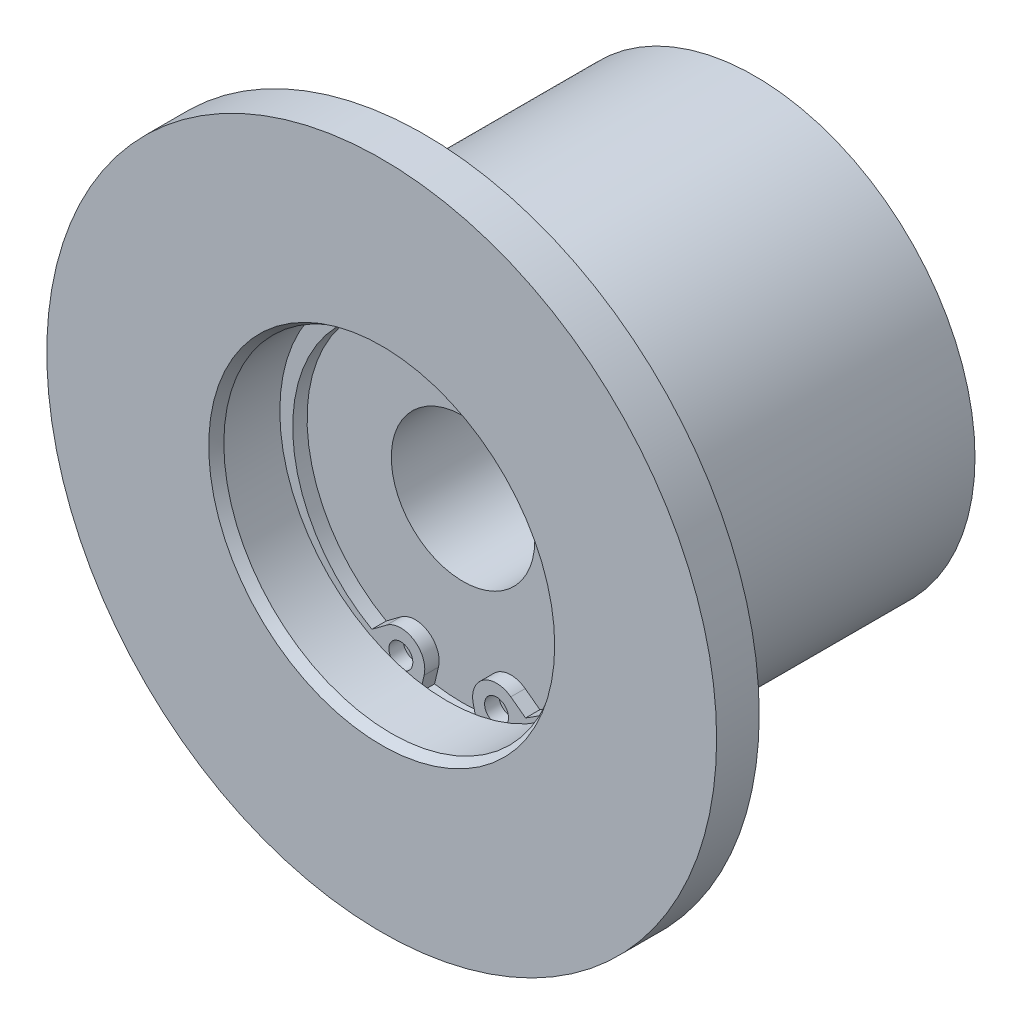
ISO-10303-21;
HEADER;
FILE_DESCRIPTION(('STEP AP214'),'2;1');
FILE_NAME('part.step','',(''),(''),'','','');
FILE_SCHEMA(('AUTOMOTIVE_DESIGN { 1 0 10303 214 1 1 1 1 }'));
ENDSEC;
DATA;
#1=APPLICATION_CONTEXT('core data for automotive mechanical design processes');
#2=APPLICATION_PROTOCOL_DEFINITION('international standard','automotive_design',2000,#1);
#3=PRODUCT_CONTEXT('',#1,'mechanical');
#4=PRODUCT('Part','Part','',(#3));
#5=PRODUCT_RELATED_PRODUCT_CATEGORY('part','',(#4));
#6=PRODUCT_DEFINITION_FORMATION('','',#4);
#7=PRODUCT_DEFINITION_CONTEXT('part definition',#1,'design');
#8=PRODUCT_DEFINITION('design','',#6,#7);
#9=PRODUCT_DEFINITION_SHAPE('','',#8);
#10=(LENGTH_UNIT() NAMED_UNIT(*) SI_UNIT(.MILLI.,.METRE.));
#11=(NAMED_UNIT(*) PLANE_ANGLE_UNIT() SI_UNIT($,.RADIAN.));
#12=(NAMED_UNIT(*) SI_UNIT($,.STERADIAN.) SOLID_ANGLE_UNIT());
#13=UNCERTAINTY_MEASURE_WITH_UNIT(LENGTH_MEASURE(1.E-05),#10,'distance_accuracy_value','');
#14=(GEOMETRIC_REPRESENTATION_CONTEXT(3) GLOBAL_UNCERTAINTY_ASSIGNED_CONTEXT((#13)) GLOBAL_UNIT_ASSIGNED_CONTEXT((#10,
#11,#12)) REPRESENTATION_CONTEXT('',''));
#15=CARTESIAN_POINT('',(0.,0.,0.));
#16=DIRECTION('',(0.,0.,1.));
#17=DIRECTION('',(1.,0.,0.));
#18=AXIS2_PLACEMENT_3D('',#15,#16,#17);
#19=CARTESIAN_POINT('',(0.,-0.9,12.6));
#20=DIRECTION('',(0.,0.,1.));
#21=DIRECTION('',(-1.,0.,0.));
#22=AXIS2_PLACEMENT_3D('',#19,#20,#21);
#23=CYLINDRICAL_SURFACE('',#22,16.3);
#24=CARTESIAN_POINT('',(0.,-0.9,12.5));
#25=DIRECTION('',(0.,0.,1.));
#26=DIRECTION('',(1.,0.,0.));
#27=AXIS2_PLACEMENT_3D('',#24,#25,#26);
#28=CIRCLE('',#27,16.3);
#29=CARTESIAN_POINT('',(-8.02922574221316,-15.0852576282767,12.5));
#30=VERTEX_POINT('',#29);
#31=CARTESIAN_POINT('',(8.02922574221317,-15.0852576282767,12.5));
#32=VERTEX_POINT('',#31);
#33=EDGE_CURVE('E275',#30,#32,#28,.F.);
#34=ORIENTED_EDGE('',*,*,#33,.F.);
#35=DIRECTION('',(0.,0.,-1.));
#36=VECTOR('',#35,1.);
#37=CARTESIAN_POINT('',(-8.02922574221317,-15.0852576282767,12.6));
#38=LINE('',#37,#36);
#39=CARTESIAN_POINT('',(-8.02922574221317,-15.0852576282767,11.));
#40=VERTEX_POINT('',#39);
#41=EDGE_CURVE('E240',#30,#40,#38,.T.);
#42=ORIENTED_EDGE('',*,*,#41,.T.);
#43=CARTESIAN_POINT('',(0.,-0.9,11.));
#44=DIRECTION('',(0.,0.,-1.));
#45=DIRECTION('',(0.,-1.,0.));
#46=AXIS2_PLACEMENT_3D('',#43,#44,#45);
#47=CIRCLE('',#46,16.3);
#48=CARTESIAN_POINT('',(8.02922574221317,-15.0852576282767,11.));
#49=VERTEX_POINT('',#48);
#50=EDGE_CURVE('E226',#40,#49,#47,.T.);
#51=ORIENTED_EDGE('',*,*,#50,.T.);
#52=DIRECTION('',(0.,0.,-1.));
#53=VECTOR('',#52,1.);
#54=CARTESIAN_POINT('',(8.02922574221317,-15.0852576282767,12.6));
#55=LINE('',#54,#53);
#56=EDGE_CURVE('E241',#32,#49,#55,.T.);
#57=ORIENTED_EDGE('',*,*,#56,.F.);
#58=EDGE_LOOP('',(#34,#42,#51,#57));
#59=FACE_BOUND('',#58,.T.);
#60=ADVANCED_FACE('F14',(#59),#23,.F.);
#61=CARTESIAN_POINT('',(6.49138441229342,-13.9421779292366,12.6));
#62=DIRECTION('',(-0.596553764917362,-0.802573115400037,0.));
#63=DIRECTION('',(-0.802573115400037,0.596553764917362,0.));
#64=AXIS2_PLACEMENT_3D('',#61,#62,#63);
#65=PLANE('',#64);
#66=DIRECTION('',(-0.802573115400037,0.596553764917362,0.));
#67=VECTOR('',#66,1.);
#68=CARTESIAN_POINT('',(6.49138441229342,-13.9421779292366,12.5));
#69=LINE('',#68,#67);
#70=CARTESIAN_POINT('',(6.49138441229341,-13.9421779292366,12.5));
#71=VERTEX_POINT('',#70);
#72=EDGE_CURVE('E277',#32,#71,#69,.T.);
#73=ORIENTED_EDGE('',*,*,#72,.F.);
#74=ORIENTED_EDGE('',*,*,#56,.T.);
#75=DIRECTION('',(-0.802573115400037,0.596553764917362,0.));
#76=VECTOR('',#75,1.);
#77=CARTESIAN_POINT('',(6.49138441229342,-13.9421779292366,11.));
#78=LINE('',#77,#76);
#79=CARTESIAN_POINT('',(6.49138441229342,-13.9421779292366,11.));
#80=VERTEX_POINT('',#79);
#81=EDGE_CURVE('E237',#49,#80,#78,.T.);
#82=ORIENTED_EDGE('',*,*,#81,.T.);
#83=DIRECTION('',(0.,0.,-1.));
#84=VECTOR('',#83,1.);
#85=CARTESIAN_POINT('',(6.49138441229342,-13.9421779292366,12.6));
#86=LINE('',#85,#84);
#87=EDGE_CURVE('E257',#71,#80,#86,.T.);
#88=ORIENTED_EDGE('',*,*,#87,.F.);
#89=EDGE_LOOP('',(#73,#74,#82,#88));
#90=FACE_BOUND('',#89,.T.);
#91=ADVANCED_FACE('F175',(#90),#65,.F.);
#92=CARTESIAN_POINT('',(5.,-15.9486107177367,12.6));
#93=DIRECTION('',(0.,0.,1.));
#94=DIRECTION('',(-1.,0.,0.));
#95=AXIS2_PLACEMENT_3D('',#92,#93,#94);
#96=CYLINDRICAL_SURFACE('',#95,2.5);
#97=DIRECTION('',(0.,0.,-1.));
#98=VECTOR('',#97,1.);
#99=CARTESIAN_POINT('',(2.5678231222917,-16.526983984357,12.6));
#100=LINE('',#99,#98);
#101=CARTESIAN_POINT('',(2.5678231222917,-16.526983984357,12.5));
#102=VERTEX_POINT('',#101);
#103=CARTESIAN_POINT('',(2.5678231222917,-16.526983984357,11.));
#104=VERTEX_POINT('',#103);
#105=EDGE_CURVE('E232',#102,#104,#100,.T.);
#106=ORIENTED_EDGE('',*,*,#105,.F.);
#107=CARTESIAN_POINT('',(5.,-15.9486107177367,12.5));
#108=DIRECTION('',(0.,0.,1.));
#109=DIRECTION('',(1.,0.,0.));
#110=AXIS2_PLACEMENT_3D('',#107,#108,#109);
#111=CIRCLE('',#110,2.5);
#112=EDGE_CURVE('E279',#102,#71,#111,.F.);
#113=ORIENTED_EDGE('',*,*,#112,.T.);
#114=ORIENTED_EDGE('',*,*,#87,.T.);
#115=CARTESIAN_POINT('',(5.,-15.9486107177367,11.));
#116=DIRECTION('',(0.,0.,1.));
#117=DIRECTION('',(1.,0.,0.));
#118=AXIS2_PLACEMENT_3D('',#115,#116,#117);
#119=CIRCLE('',#118,2.5);
#120=EDGE_CURVE('E113',#80,#104,#119,.T.);
#121=ORIENTED_EDGE('',*,*,#120,.T.);
#122=EDGE_LOOP('',(#106,#113,#114,#121));
#123=FACE_BOUND('',#122,.T.);
#124=ADVANCED_FACE('F181',(#123),#96,.T.);
#125=CARTESIAN_POINT('',(-2.56782312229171,-16.526983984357,12.6));
#126=DIRECTION('',(-0.97287075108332,0.231349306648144,0.));
#127=DIRECTION('',(0.,0.,1.));
#128=AXIS2_PLACEMENT_3D('',#125,#126,#127);
#129=PLANE('',#128);
#130=DIRECTION('',(0.231349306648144,0.97287075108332,0.));
#131=VECTOR('',#130,1.);
#132=CARTESIAN_POINT('',(-2.56782312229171,-16.526983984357,12.5));
#133=LINE('',#132,#131);
#134=CARTESIAN_POINT('',(-2.97957431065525,-18.2584812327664,12.5));
#135=VERTEX_POINT('',#134);
#136=CARTESIAN_POINT('',(-2.5678231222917,-16.526983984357,12.5));
#137=VERTEX_POINT('',#136);
#138=EDGE_CURVE('E89',#135,#137,#133,.T.);
#139=ORIENTED_EDGE('',*,*,#138,.F.);
#140=DIRECTION('',(0.,0.,1.));
#141=VECTOR('',#140,1.);
#142=CARTESIAN_POINT('',(-2.97957431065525,-18.2584812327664,12.1183293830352));
#143=LINE('',#142,#141);
#144=CARTESIAN_POINT('',(-2.97957431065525,-18.2584812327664,11.));
#145=VERTEX_POINT('',#144);
#146=EDGE_CURVE('E22',#145,#135,#143,.T.);
#147=ORIENTED_EDGE('',*,*,#146,.F.);
#148=DIRECTION('',(0.231349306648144,0.97287075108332,0.));
#149=VECTOR('',#148,1.);
#150=CARTESIAN_POINT('',(-2.56782312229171,-16.526983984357,11.));
#151=LINE('',#150,#149);
#152=CARTESIAN_POINT('',(-2.56782312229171,-16.526983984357,11.));
#153=VERTEX_POINT('',#152);
#154=EDGE_CURVE('E35',#145,#153,#151,.T.);
#155=ORIENTED_EDGE('',*,*,#154,.T.);
#156=DIRECTION('',(0.,0.,-1.));
#157=VECTOR('',#156,1.);
#158=CARTESIAN_POINT('',(-2.56782312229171,-16.526983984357,12.6));
#159=LINE('',#158,#157);
#160=EDGE_CURVE('E98',#137,#153,#159,.T.);
#161=ORIENTED_EDGE('',*,*,#160,.F.);
#162=EDGE_LOOP('',(#139,#147,#155,#161));
#163=FACE_BOUND('',#162,.T.);
#164=ADVANCED_FACE('F97',(#163),#129,.F.);
#165=CARTESIAN_POINT('',(-6.49138441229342,-13.9421779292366,12.6));
#166=DIRECTION('',(0.596553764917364,-0.802573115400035,0.));
#167=DIRECTION('',(0.,0.,-1.));
#168=AXIS2_PLACEMENT_3D('',#165,#166,#167);
#169=PLANE('',#168);
#170=DIRECTION('',(-0.802573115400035,-0.596553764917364,0.));
#171=VECTOR('',#170,1.);
#172=CARTESIAN_POINT('',(-6.49138441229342,-13.9421779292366,12.5));
#173=LINE('',#172,#171);
#174=CARTESIAN_POINT('',(-6.49138441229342,-13.9421779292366,12.5));
#175=VERTEX_POINT('',#174);
#176=EDGE_CURVE('E273',#175,#30,#173,.T.);
#177=ORIENTED_EDGE('',*,*,#176,.F.);
#178=DIRECTION('',(0.,0.,-1.));
#179=VECTOR('',#178,1.);
#180=CARTESIAN_POINT('',(-6.49138441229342,-13.9421779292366,12.6));
#181=LINE('',#180,#179);
#182=CARTESIAN_POINT('',(-6.49138441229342,-13.9421779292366,11.));
#183=VERTEX_POINT('',#182);
#184=EDGE_CURVE('E109',#175,#183,#181,.T.);
#185=ORIENTED_EDGE('',*,*,#184,.T.);
#186=DIRECTION('',(-0.802573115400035,-0.596553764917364,0.));
#187=VECTOR('',#186,1.);
#188=CARTESIAN_POINT('',(-6.49138441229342,-13.9421779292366,11.));
#189=LINE('',#188,#187);
#190=EDGE_CURVE('E105',#183,#40,#189,.T.);
#191=ORIENTED_EDGE('',*,*,#190,.T.);
#192=ORIENTED_EDGE('',*,*,#41,.F.);
#193=EDGE_LOOP('',(#177,#185,#191,#192));
#194=FACE_BOUND('',#193,.T.);
#195=ADVANCED_FACE('F191',(#194),#169,.F.);
#196=CARTESIAN_POINT('',(-5.,-15.9486107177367,12.6));
#197=DIRECTION('',(0.,0.,1.));
#198=DIRECTION('',(-1.,0.,0.));
#199=AXIS2_PLACEMENT_3D('',#196,#197,#198);
#200=CYLINDRICAL_SURFACE('',#199,2.5);
#201=ORIENTED_EDGE('',*,*,#184,.F.);
#202=CARTESIAN_POINT('',(-5.,-15.9486107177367,12.5));
#203=DIRECTION('',(0.,0.,1.));
#204=DIRECTION('',(1.,0.,0.));
#205=AXIS2_PLACEMENT_3D('',#202,#203,#204);
#206=CIRCLE('',#205,2.5);
#207=EDGE_CURVE('E100',#175,#137,#206,.F.);
#208=ORIENTED_EDGE('',*,*,#207,.T.);
#209=ORIENTED_EDGE('',*,*,#160,.T.);
#210=CARTESIAN_POINT('',(-5.,-15.9486107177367,11.));
#211=DIRECTION('',(0.,0.,1.));
#212=DIRECTION('',(-1.,0.,0.));
#213=AXIS2_PLACEMENT_3D('',#210,#211,#212);
#214=CIRCLE('',#213,2.5);
#215=EDGE_CURVE('E214',#153,#183,#214,.T.);
#216=ORIENTED_EDGE('',*,*,#215,.T.);
#217=EDGE_LOOP('',(#201,#208,#209,#216));
#218=FACE_BOUND('',#217,.T.);
#219=ADVANCED_FACE('F198',(#218),#200,.T.);
#220=CARTESIAN_POINT('',(2.5678231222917,-16.526983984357,12.6));
#221=DIRECTION('',(0.972870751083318,0.231349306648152,0.));
#222=DIRECTION('',(0.,0.,-1.));
#223=AXIS2_PLACEMENT_3D('',#220,#221,#222);
#224=PLANE('',#223);
#225=DIRECTION('',(0.231349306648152,-0.972870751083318,0.));
#226=VECTOR('',#225,1.);
#227=CARTESIAN_POINT('',(2.5678231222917,-16.526983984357,12.5));
#228=LINE('',#227,#226);
#229=CARTESIAN_POINT('',(2.97957431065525,-18.2584812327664,12.5));
#230=VERTEX_POINT('',#229);
#231=EDGE_CURVE('E92',#102,#230,#228,.T.);
#232=ORIENTED_EDGE('',*,*,#231,.F.);
#233=ORIENTED_EDGE('',*,*,#105,.T.);
#234=DIRECTION('',(0.231349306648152,-0.972870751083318,0.));
#235=VECTOR('',#234,1.);
#236=CARTESIAN_POINT('',(2.5678231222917,-16.526983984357,11.));
#237=LINE('',#236,#235);
#238=CARTESIAN_POINT('',(2.97957431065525,-18.2584812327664,11.));
#239=VERTEX_POINT('',#238);
#240=EDGE_CURVE('E230',#104,#239,#237,.T.);
#241=ORIENTED_EDGE('',*,*,#240,.T.);
#242=DIRECTION('',(0.,0.,1.));
#243=VECTOR('',#242,1.);
#244=CARTESIAN_POINT('',(2.97957431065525,-18.2584812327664,12.1183293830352));
#245=LINE('',#244,#243);
#246=EDGE_CURVE('E9',#230,#239,#245,.F.);
#247=ORIENTED_EDGE('',*,*,#246,.F.);
#248=EDGE_LOOP('',(#232,#233,#241,#247));
#249=FACE_BOUND('',#248,.T.);
#250=ADVANCED_FACE('F187',(#249),#224,.F.);
#251=CARTESIAN_POINT('',(0.,0.,14.));
#252=DIRECTION('',(0.,0.,1.));
#253=DIRECTION('',(1.,0.,0.));
#254=AXIS2_PLACEMENT_3D('',#251,#252,#253);
#255=CONICAL_SURFACE('',#254,23.,1.48352986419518);
#256=CARTESIAN_POINT('',(0.,0.,15.0498639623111));
#257=DIRECTION('',(0.,0.,1.));
#258=DIRECTION('',(1.,0.,0.));
#259=AXIS2_PLACEMENT_3D('',#256,#257,#258);
#260=CIRCLE('',#259,35.);
#261=CARTESIAN_POINT('',(35.,0.,15.0498639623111));
#262=VERTEX_POINT('',#261);
#263=EDGE_CURVE('E145',#262,#262,#260,.T.);
#264=ORIENTED_EDGE('',*,*,#263,.F.);
#265=EDGE_LOOP('',(#264));
#266=FACE_BOUND('',#265,.T.);
#267=CARTESIAN_POINT('',(0.,0.,14.));
#268=DIRECTION('',(0.,0.,1.));
#269=DIRECTION('',(1.,0.,0.));
#270=AXIS2_PLACEMENT_3D('',#267,#268,#269);
#271=CIRCLE('',#270,23.);
#272=CARTESIAN_POINT('',(23.,0.,14.));
#273=VERTEX_POINT('',#272);
#274=EDGE_CURVE('E148',#273,#273,#271,.T.);
#275=ORIENTED_EDGE('',*,*,#274,.T.);
#276=EDGE_LOOP('',(#275));
#277=FACE_BOUND('',#276,.T.);
#278=ADVANCED_FACE('F210',(#266,#277),#255,.T.);
#279=CARTESIAN_POINT('',(0.,0.,12.1183293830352));
#280=DIRECTION('',(0.,0.,1.));
#281=DIRECTION('',(1.,0.,0.));
#282=AXIS2_PLACEMENT_3D('',#279,#280,#281);
#283=CYLINDRICAL_SURFACE('',#282,35.);
#284=CARTESIAN_POINT('',(0.,0.,19.5));
#285=DIRECTION('',(0.,0.,1.));
#286=DIRECTION('',(1.,0.,0.));
#287=AXIS2_PLACEMENT_3D('',#284,#285,#286);
#288=CIRCLE('',#287,35.);
#289=CARTESIAN_POINT('',(35.,0.,19.5));
#290=VERTEX_POINT('',#289);
#291=EDGE_CURVE('E142',#290,#290,#288,.T.);
#292=ORIENTED_EDGE('',*,*,#291,.F.);
#293=EDGE_LOOP('',(#292));
#294=FACE_BOUND('',#293,.T.);
#295=ORIENTED_EDGE('',*,*,#263,.T.);
#296=EDGE_LOOP('',(#295));
#297=FACE_BOUND('',#296,.T.);
#298=ADVANCED_FACE('F394',(#294,#297),#283,.T.);
#299=CARTESIAN_POINT('',(0.,0.,12.1183293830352));
#300=DIRECTION('',(0.,0.,1.));
#301=DIRECTION('',(1.,0.,0.));
#302=AXIS2_PLACEMENT_3D('',#299,#300,#301);
#303=CYLINDRICAL_SURFACE('',#302,23.);
#304=ORIENTED_EDGE('',*,*,#274,.F.);
#305=EDGE_LOOP('',(#304));
#306=FACE_BOUND('',#305,.T.);
#307=CARTESIAN_POINT('',(0.,0.,-19.5));
#308=DIRECTION('',(0.,0.,1.));
#309=DIRECTION('',(1.,0.,0.));
#310=AXIS2_PLACEMENT_3D('',#307,#308,#309);
#311=CIRCLE('',#310,23.);
#312=CARTESIAN_POINT('',(23.,0.,-19.5));
#313=VERTEX_POINT('',#312);
#314=EDGE_CURVE('E120',#313,#313,#311,.T.);
#315=ORIENTED_EDGE('',*,*,#314,.T.);
#316=EDGE_LOOP('',(#315));
#317=FACE_BOUND('',#316,.T.);
#318=ADVANCED_FACE('F16',(#306,#317),#303,.T.);
#319=CARTESIAN_POINT('',(0.,35.,19.5));
#320=DIRECTION('',(0.,0.,-1.));
#321=DIRECTION('',(-1.,0.,0.));
#322=AXIS2_PLACEMENT_3D('',#319,#320,#321);
#323=PLANE('',#322);
#324=CARTESIAN_POINT('',(0.,0.,19.5));
#325=DIRECTION('',(0.,0.,1.));
#326=DIRECTION('',(1.,0.,0.));
#327=AXIS2_PLACEMENT_3D('',#324,#325,#326);
#328=CIRCLE('',#327,18.0773502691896);
#329=CARTESIAN_POINT('',(18.0773502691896,0.,19.5));
#330=VERTEX_POINT('',#329);
#331=EDGE_CURVE('E139',#330,#330,#328,.T.);
#332=ORIENTED_EDGE('',*,*,#331,.F.);
#333=EDGE_LOOP('',(#332));
#334=FACE_BOUND('',#333,.T.);
#335=ORIENTED_EDGE('',*,*,#291,.T.);
#336=EDGE_LOOP('',(#335));
#337=FACE_BOUND('',#336,.T.);
#338=ADVANCED_FACE('F410',(#334,#337),#323,.F.);
#339=CARTESIAN_POINT('',(0.,14.5,-19.5));
#340=DIRECTION('',(0.,0.,1.));
#341=DIRECTION('',(1.,0.,0.));
#342=AXIS2_PLACEMENT_3D('',#339,#340,#341);
#343=PLANE('',#342);
#344=ORIENTED_EDGE('',*,*,#314,.F.);
#345=EDGE_LOOP('',(#344));
#346=FACE_BOUND('',#345,.T.);
#347=CARTESIAN_POINT('',(0.,0.,-19.5));
#348=DIRECTION('',(0.,0.,1.));
#349=DIRECTION('',(1.,0.,0.));
#350=AXIS2_PLACEMENT_3D('',#347,#348,#349);
#351=CIRCLE('',#350,14.5);
#352=CARTESIAN_POINT('',(14.5,0.,-19.5));
#353=VERTEX_POINT('',#352);
#354=EDGE_CURVE('E123',#353,#353,#351,.T.);
#355=ORIENTED_EDGE('',*,*,#354,.T.);
#356=EDGE_LOOP('',(#355));
#357=FACE_BOUND('',#356,.T.);
#358=ADVANCED_FACE('F418',(#346,#357),#343,.F.);
#359=CARTESIAN_POINT('',(0.,0.,19.5));
#360=DIRECTION('',(0.,0.,1.));
#361=DIRECTION('',(1.,0.,0.));
#362=AXIS2_PLACEMENT_3D('',#359,#360,#361);
#363=CONICAL_SURFACE('',#362,18.0773502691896,0.523598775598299);
#364=CARTESIAN_POINT('',(0.,0.,18.5));
#365=DIRECTION('',(0.,0.,1.));
#366=DIRECTION('',(1.,0.,0.));
#367=AXIS2_PLACEMENT_3D('',#364,#365,#366);
#368=CIRCLE('',#367,17.5);
#369=CARTESIAN_POINT('',(17.5,0.,18.5));
#370=VERTEX_POINT('',#369);
#371=EDGE_CURVE('E136',#370,#370,#368,.T.);
#372=ORIENTED_EDGE('',*,*,#371,.F.);
#373=EDGE_LOOP('',(#372));
#374=FACE_BOUND('',#373,.T.);
#375=ORIENTED_EDGE('',*,*,#331,.T.);
#376=EDGE_LOOP('',(#375));
#377=FACE_BOUND('',#376,.T.);
#378=ADVANCED_FACE('F427',(#374,#377),#363,.F.);
#379=CARTESIAN_POINT('',(0.,0.,12.1183293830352));
#380=DIRECTION('',(0.,0.,1.));
#381=DIRECTION('',(1.,0.,0.));
#382=AXIS2_PLACEMENT_3D('',#379,#380,#381);
#383=CYLINDRICAL_SURFACE('',#382,14.5);
#384=ORIENTED_EDGE('',*,*,#354,.F.);
#385=EDGE_LOOP('',(#384));
#386=FACE_BOUND('',#385,.T.);
#387=CARTESIAN_POINT('',(0.,0.,-11.));
#388=DIRECTION('',(0.,0.,1.));
#389=DIRECTION('',(1.,0.,0.));
#390=AXIS2_PLACEMENT_3D('',#387,#388,#389);
#391=CIRCLE('',#390,14.5);
#392=CARTESIAN_POINT('',(14.5,0.,-11.));
#393=VERTEX_POINT('',#392);
#394=EDGE_CURVE('E126',#393,#393,#391,.T.);
#395=ORIENTED_EDGE('',*,*,#394,.T.);
#396=EDGE_LOOP('',(#395));
#397=FACE_BOUND('',#396,.T.);
#398=ADVANCED_FACE('F435',(#386,#397),#383,.F.);
#399=CARTESIAN_POINT('',(0.,0.,12.1183293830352));
#400=DIRECTION('',(0.,0.,1.));
#401=DIRECTION('',(1.,0.,0.));
#402=AXIS2_PLACEMENT_3D('',#399,#400,#401);
#403=CYLINDRICAL_SURFACE('',#402,17.5);
#404=CARTESIAN_POINT('',(0.,0.,12.65));
#405=DIRECTION('',(0.,0.,1.));
#406=DIRECTION('',(1.,0.,0.));
#407=AXIS2_PLACEMENT_3D('',#404,#405,#406);
#408=CIRCLE('',#407,17.5);
#409=CARTESIAN_POINT('',(17.5,0.,12.65));
#410=VERTEX_POINT('',#409);
#411=EDGE_CURVE('E118',#410,#410,#408,.F.);
#412=ORIENTED_EDGE('',*,*,#411,.T.);
#413=EDGE_LOOP('',(#412));
#414=FACE_BOUND('',#413,.T.);
#415=ORIENTED_EDGE('',*,*,#371,.T.);
#416=EDGE_LOOP('',(#415));
#417=FACE_BOUND('',#416,.T.);
#418=ADVANCED_FACE('F154',(#414,#417),#403,.F.);
#419=CARTESIAN_POINT('',(0.,14.5,-11.));
#420=DIRECTION('',(0.,0.,1.));
#421=DIRECTION('',(1.,0.,0.));
#422=AXIS2_PLACEMENT_3D('',#419,#420,#421);
#423=PLANE('',#422);
#424=ORIENTED_EDGE('',*,*,#394,.F.);
#425=EDGE_LOOP('',(#424));
#426=FACE_BOUND('',#425,.T.);
#427=CARTESIAN_POINT('',(0.,0.,-11.));
#428=DIRECTION('',(0.,0.,1.));
#429=DIRECTION('',(1.,0.,0.));
#430=AXIS2_PLACEMENT_3D('',#427,#428,#429);
#431=CIRCLE('',#430,7.5);
#432=CARTESIAN_POINT('',(7.5,0.,-11.));
#433=VERTEX_POINT('',#432);
#434=EDGE_CURVE('E129',#433,#433,#431,.T.);
#435=ORIENTED_EDGE('',*,*,#434,.T.);
#436=EDGE_LOOP('',(#435));
#437=FACE_BOUND('',#436,.T.);
#438=ADVANCED_FACE('F159',(#426,#437),#423,.F.);
#439=CARTESIAN_POINT('',(0.,0.,12.65));
#440=DIRECTION('',(0.,0.,1.));
#441=DIRECTION('',(1.,0.,0.));
#442=AXIS2_PLACEMENT_3D('',#439,#440,#441);
#443=PLANE('',#442);
#444=CARTESIAN_POINT('',(0.,0.,12.65));
#445=DIRECTION('',(0.,0.,1.));
#446=DIRECTION('',(1.,0.,0.));
#447=AXIS2_PLACEMENT_3D('',#444,#445,#446);
#448=CIRCLE('',#447,18.5);
#449=CARTESIAN_POINT('',(18.5,0.,12.65));
#450=VERTEX_POINT('',#449);
#451=EDGE_CURVE('E115',#450,#450,#448,.T.);
#452=ORIENTED_EDGE('',*,*,#451,.F.);
#453=EDGE_LOOP('',(#452));
#454=FACE_BOUND('',#453,.T.);
#455=ORIENTED_EDGE('',*,*,#411,.F.);
#456=EDGE_LOOP('',(#455));
#457=FACE_BOUND('',#456,.T.);
#458=ADVANCED_FACE('F157',(#454,#457),#443,.F.);
#459=CARTESIAN_POINT('',(0.,0.,12.1183293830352));
#460=DIRECTION('',(0.,0.,1.));
#461=DIRECTION('',(1.,0.,0.));
#462=AXIS2_PLACEMENT_3D('',#459,#460,#461);
#463=CYLINDRICAL_SURFACE('',#462,18.5);
#464=CARTESIAN_POINT('',(0.,0.,12.5));
#465=DIRECTION('',(0.,0.,1.));
#466=DIRECTION('',(1.,0.,0.));
#467=AXIS2_PLACEMENT_3D('',#464,#465,#466);
#468=CIRCLE('',#467,18.5);
#469=EDGE_CURVE('E85',#230,#135,#468,.T.);
#470=ORIENTED_EDGE('',*,*,#469,.F.);
#471=ORIENTED_EDGE('',*,*,#246,.T.);
#472=CARTESIAN_POINT('',(0.,0.,11.));
#473=DIRECTION('',(0.,0.,1.));
#474=DIRECTION('',(1.,0.,0.));
#475=AXIS2_PLACEMENT_3D('',#472,#473,#474);
#476=CIRCLE('',#475,18.5);
#477=EDGE_CURVE('E104',#145,#239,#476,.T.);
#478=ORIENTED_EDGE('',*,*,#477,.F.);
#479=ORIENTED_EDGE('',*,*,#146,.T.);
#480=EDGE_LOOP('',(#470,#471,#478,#479));
#481=FACE_BOUND('',#480,.T.);
#482=ORIENTED_EDGE('',*,*,#451,.T.);
#483=EDGE_LOOP('',(#482));
#484=FACE_BOUND('',#483,.T.);
#485=ADVANCED_FACE('F102',(#481,#484),#463,.F.);
#486=CARTESIAN_POINT('',(0.,0.,12.1183293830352));
#487=DIRECTION('',(0.,0.,1.));
#488=DIRECTION('',(1.,0.,0.));
#489=AXIS2_PLACEMENT_3D('',#486,#487,#488);
#490=CYLINDRICAL_SURFACE('',#489,7.5);
#491=ORIENTED_EDGE('',*,*,#434,.F.);
#492=EDGE_LOOP('',(#491));
#493=FACE_BOUND('',#492,.T.);
#494=CARTESIAN_POINT('',(0.,0.,11.));
#495=DIRECTION('',(0.,0.,1.));
#496=DIRECTION('',(1.,0.,0.));
#497=AXIS2_PLACEMENT_3D('',#494,#495,#496);
#498=CIRCLE('',#497,7.5);
#499=CARTESIAN_POINT('',(7.5,0.,11.));
#500=VERTEX_POINT('',#499);
#501=EDGE_CURVE('E132',#500,#500,#498,.T.);
#502=ORIENTED_EDGE('',*,*,#501,.T.);
#503=EDGE_LOOP('',(#502));
#504=FACE_BOUND('',#503,.T.);
#505=ADVANCED_FACE('F167',(#493,#504),#490,.F.);
#506=CARTESIAN_POINT('',(0.,7.5,11.));
#507=DIRECTION('',(0.,0.,-1.));
#508=DIRECTION('',(-1.,0.,0.));
#509=AXIS2_PLACEMENT_3D('',#506,#507,#508);
#510=PLANE('',#509);
#511=ORIENTED_EDGE('',*,*,#501,.F.);
#512=EDGE_LOOP('',(#511));
#513=FACE_BOUND('',#512,.T.);
#514=ORIENTED_EDGE('',*,*,#477,.T.);
#515=ORIENTED_EDGE('',*,*,#240,.F.);
#516=ORIENTED_EDGE('',*,*,#120,.F.);
#517=ORIENTED_EDGE('',*,*,#81,.F.);
#518=ORIENTED_EDGE('',*,*,#50,.F.);
#519=ORIENTED_EDGE('',*,*,#190,.F.);
#520=ORIENTED_EDGE('',*,*,#215,.F.);
#521=ORIENTED_EDGE('',*,*,#154,.F.);
#522=EDGE_LOOP('',(#514,#515,#516,#517,#518,#519,#520,#521));
#523=FACE_BOUND('',#522,.T.);
#524=ADVANCED_FACE('F286',(#513,#523),#510,.F.);
#525=CARTESIAN_POINT('',(0.,0.,12.5));
#526=DIRECTION('',(0.,0.,1.));
#527=DIRECTION('',(1.,0.,0.));
#528=AXIS2_PLACEMENT_3D('',#525,#526,#527);
#529=PLANE('',#528);
#530=ORIENTED_EDGE('',*,*,#138,.T.);
#531=ORIENTED_EDGE('',*,*,#207,.F.);
#532=ORIENTED_EDGE('',*,*,#176,.T.);
#533=ORIENTED_EDGE('',*,*,#33,.T.);
#534=ORIENTED_EDGE('',*,*,#72,.T.);
#535=ORIENTED_EDGE('',*,*,#112,.F.);
#536=ORIENTED_EDGE('',*,*,#231,.T.);
#537=ORIENTED_EDGE('',*,*,#469,.T.);
#538=EDGE_LOOP('',(#530,#531,#532,#533,#534,#535,#536,#537));
#539=FACE_BOUND('',#538,.T.);
#540=CARTESIAN_POINT('',(-5.,-15.9486107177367,12.5));
#541=DIRECTION('',(0.,0.,1.));
#542=DIRECTION('',(1.,0.,0.));
#543=AXIS2_PLACEMENT_3D('',#540,#541,#542);
#544=CIRCLE('',#543,1.25);
#545=CARTESIAN_POINT('',(-3.75,-15.9486107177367,12.5));
#546=VERTEX_POINT('',#545);
#547=EDGE_CURVE('E99',#546,#546,#544,.F.);
#548=ORIENTED_EDGE('',*,*,#547,.T.);
#549=EDGE_LOOP('',(#548));
#550=FACE_BOUND('',#549,.T.);
#551=CARTESIAN_POINT('',(5.,-15.9486107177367,12.5));
#552=DIRECTION('',(0.,0.,1.));
#553=DIRECTION('',(1.,0.,0.));
#554=AXIS2_PLACEMENT_3D('',#551,#552,#553);
#555=CIRCLE('',#554,1.25);
#556=CARTESIAN_POINT('',(6.25,-15.9486107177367,12.5));
#557=VERTEX_POINT('',#556);
#558=EDGE_CURVE('E119',#557,#557,#555,.F.);
#559=ORIENTED_EDGE('',*,*,#558,.T.);
#560=EDGE_LOOP('',(#559));
#561=FACE_BOUND('',#560,.T.);
#562=ADVANCED_FACE('F87',(#539,#550,#561),#529,.T.);
#563=CARTESIAN_POINT('',(-5.,-15.9486107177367,11.));
#564=DIRECTION('',(0.,0.,-1.));
#565=DIRECTION('',(1.,0.,0.));
#566=AXIS2_PLACEMENT_3D('',#563,#564,#565);
#567=CIRCLE('',#566,1.25);
#568=CARTESIAN_POINT('',(-3.75,-15.9486107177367,11.));
#569=VERTEX_POINT('',#568);
#570=EDGE_CURVE('E150',#569,#569,#567,.T.);
#571=ORIENTED_EDGE('',*,*,#570,.F.);
#572=EDGE_LOOP('',(#571));
#573=FACE_BOUND('',#572,.T.);
#574=ADVANCED_FACE('F203',(#573),#510,.F.);
#575=CARTESIAN_POINT('',(-5.,-15.9486107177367,12.6));
#576=DIRECTION('',(0.,0.,1.));
#577=DIRECTION('',(-1.,0.,0.));
#578=AXIS2_PLACEMENT_3D('',#575,#576,#577);
#579=CYLINDRICAL_SURFACE('',#578,1.25);
#580=ORIENTED_EDGE('',*,*,#570,.T.);
#581=EDGE_LOOP('',(#580));
#582=FACE_BOUND('',#581,.T.);
#583=ORIENTED_EDGE('',*,*,#547,.F.);
#584=EDGE_LOOP('',(#583));
#585=FACE_BOUND('',#584,.T.);
#586=ADVANCED_FACE('F201',(#582,#585),#579,.F.);
#587=CARTESIAN_POINT('',(5.,-15.9486107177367,11.));
#588=DIRECTION('',(0.,0.,1.));
#589=DIRECTION('',(1.,0.,0.));
#590=AXIS2_PLACEMENT_3D('',#587,#588,#589);
#591=CIRCLE('',#590,1.25);
#592=CARTESIAN_POINT('',(6.25,-15.9486107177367,11.));
#593=VERTEX_POINT('',#592);
#594=EDGE_CURVE('E218',#593,#593,#591,.T.);
#595=ORIENTED_EDGE('',*,*,#594,.T.);
#596=EDGE_LOOP('',(#595));
#597=FACE_BOUND('',#596,.T.);
#598=ADVANCED_FACE('F195',(#597),#510,.F.);
#599=CARTESIAN_POINT('',(5.,-15.9486107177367,12.6));
#600=DIRECTION('',(0.,0.,1.));
#601=DIRECTION('',(-1.,0.,0.));
#602=AXIS2_PLACEMENT_3D('',#599,#600,#601);
#603=CYLINDRICAL_SURFACE('',#602,1.25);
#604=ORIENTED_EDGE('',*,*,#594,.F.);
#605=EDGE_LOOP('',(#604));
#606=FACE_BOUND('',#605,.T.);
#607=ORIENTED_EDGE('',*,*,#558,.F.);
#608=EDGE_LOOP('',(#607));
#609=FACE_BOUND('',#608,.T.);
#610=ADVANCED_FACE('F192',(#606,#609),#603,.F.);
#611=CLOSED_SHELL('',(#60,#91,#124,#164,#195,#219,#250,#278,#298,#318,#338,#358,#378,#398,#418,
#438,#458,#485,#505,#524,#562,#574,#586,#598,#610));
#612=MANIFOLD_SOLID_BREP('B1',#611);
#613=ADVANCED_BREP_SHAPE_REPRESENTATION('',(#18,#612),#14);
#614=SHAPE_DEFINITION_REPRESENTATION(#9,#613);
ENDSEC;
END-ISO-10303-21;
